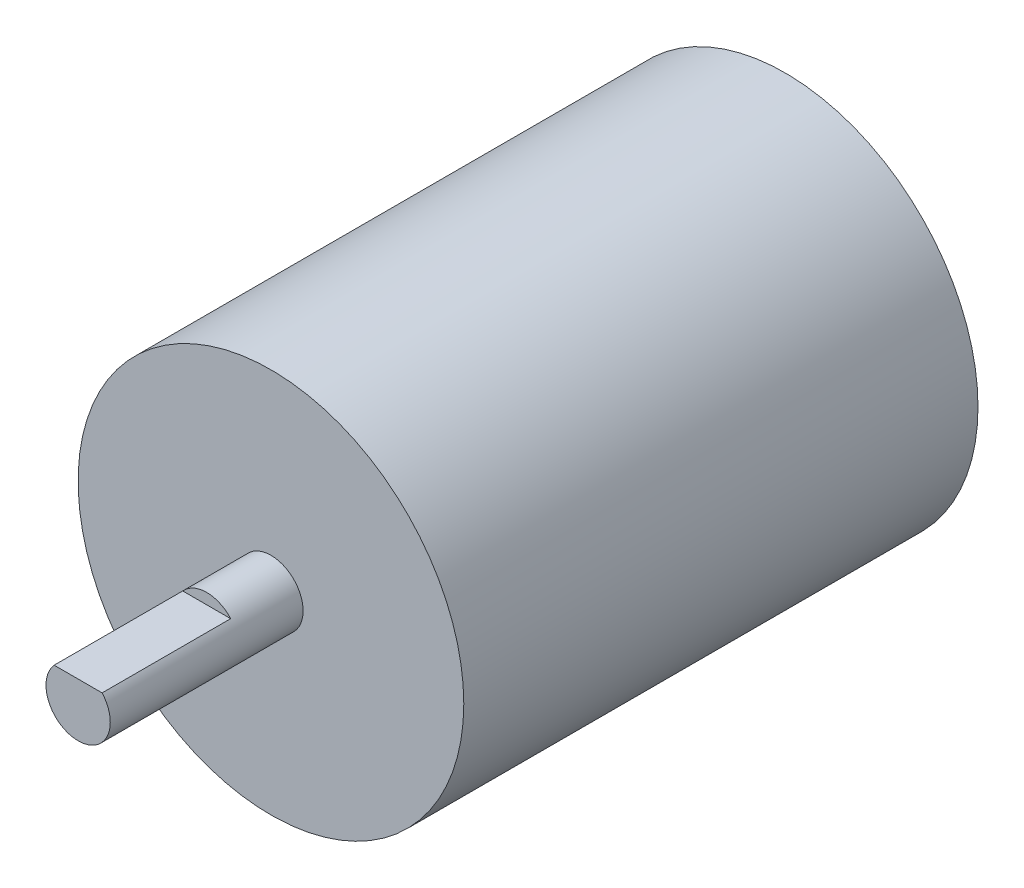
from build123d import *

# Parameters (mm, degrees)
SKETCH1_R           = 19.05
BOSS_EXTRUDE1_DEPTH = 50.8
SKETCH2_R           = 3.175
BOSS_EXTRUDE2_DEPTH = 19.05
SKETCH3_W           = 7.575380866
SKETCH3_H           = 1.446687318
CUT_EXTRUDE1_DEPTH  = 12.7


with BuildPart() as part:
    # Sketch1 → Boss-Extrude1 (new body)
    with BuildSketch(Plane.XY):
        Circle(SKETCH1_R)
    extrude(amount=BOSS_EXTRUDE1_DEPTH)

    # Sketch2 → Boss-Extrude2 (add)
    with BuildSketch(Plane.XY.offset(50.8)):
        with Locations(Location((0, 0, 0), (0, 0, 180))):
            Circle(SKETCH2_R)
    extrude(amount=BOSS_EXTRUDE2_DEPTH)

    # Sketch3 → Cut-Extrude1 (cut)
    with BuildSketch(Plane.XY.offset(69.85)):
        with Locations((0.155919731, 2.835726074)):
            Rectangle(SKETCH3_W, SKETCH3_H)
    extrude(amount=-CUT_EXTRUDE1_DEPTH, mode=Mode.SUBTRACT)


solid = part.part
